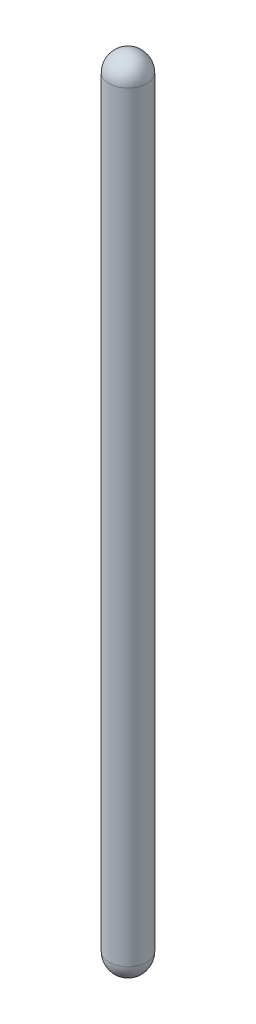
ISO-10303-21;
HEADER;
FILE_DESCRIPTION(('STEP AP214'),'2;1');
FILE_NAME('part.step','',(''),(''),'','','');
FILE_SCHEMA(('AUTOMOTIVE_DESIGN { 1 0 10303 214 1 1 1 1 }'));
ENDSEC;
DATA;
#1=APPLICATION_CONTEXT('core data for automotive mechanical design processes');
#2=APPLICATION_PROTOCOL_DEFINITION('international standard','automotive_design',2000,#1);
#3=PRODUCT_CONTEXT('',#1,'mechanical');
#4=PRODUCT('Part','Part','',(#3));
#5=PRODUCT_RELATED_PRODUCT_CATEGORY('part','',(#4));
#6=PRODUCT_DEFINITION_FORMATION('','',#4);
#7=PRODUCT_DEFINITION_CONTEXT('part definition',#1,'design');
#8=PRODUCT_DEFINITION('design','',#6,#7);
#9=PRODUCT_DEFINITION_SHAPE('','',#8);
#10=(LENGTH_UNIT() NAMED_UNIT(*) SI_UNIT(.MILLI.,.METRE.));
#11=(NAMED_UNIT(*) PLANE_ANGLE_UNIT() SI_UNIT($,.RADIAN.));
#12=(NAMED_UNIT(*) SI_UNIT($,.STERADIAN.) SOLID_ANGLE_UNIT());
#13=UNCERTAINTY_MEASURE_WITH_UNIT(LENGTH_MEASURE(1.E-05),#10,'distance_accuracy_value','');
#14=(GEOMETRIC_REPRESENTATION_CONTEXT(3) GLOBAL_UNCERTAINTY_ASSIGNED_CONTEXT((#13)) GLOBAL_UNIT_ASSIGNED_CONTEXT((#10,
#11,#12)) REPRESENTATION_CONTEXT('',''));
#15=CARTESIAN_POINT('',(0.,0.,0.));
#16=DIRECTION('',(0.,0.,1.));
#17=DIRECTION('',(1.,0.,0.));
#18=AXIS2_PLACEMENT_3D('',#15,#16,#17);
#19=CARTESIAN_POINT('',(0.,200.,0.));
#20=DIRECTION('',(0.,-1.,0.));
#21=DIRECTION('',(0.,0.,-1.));
#22=AXIS2_PLACEMENT_3D('',#19,#20,#21);
#23=CYLINDRICAL_SURFACE('',#22,4.975);
#24=CARTESIAN_POINT('',(0.,200.,0.));
#25=DIRECTION('',(0.,1.,0.));
#26=DIRECTION('',(0.,0.,1.));
#27=AXIS2_PLACEMENT_3D('',#24,#25,#26);
#28=CIRCLE('',#27,4.975);
#29=CARTESIAN_POINT('',(0.,200.,4.975));
#30=VERTEX_POINT('',#29);
#31=EDGE_CURVE('E10',#30,#30,#28,.T.);
#32=ORIENTED_EDGE('',*,*,#31,.F.);
#33=EDGE_LOOP('',(#32));
#34=FACE_BOUND('',#33,.T.);
#35=CARTESIAN_POINT('',(0.,0.,0.));
#36=DIRECTION('',(0.,1.,0.));
#37=DIRECTION('',(0.,0.,1.));
#38=AXIS2_PLACEMENT_3D('',#35,#36,#37);
#39=CIRCLE('',#38,4.975);
#40=CARTESIAN_POINT('',(0.,0.,4.975));
#41=VERTEX_POINT('',#40);
#42=EDGE_CURVE('E37',#41,#41,#39,.T.);
#43=ORIENTED_EDGE('',*,*,#42,.T.);
#44=EDGE_LOOP('',(#43));
#45=FACE_BOUND('',#44,.T.);
#46=ADVANCED_FACE('F33',(#34,#45),#23,.T.);
#47=CARTESIAN_POINT('',(0.,200.,0.));
#48=DIRECTION('',(0.,0.,1.));
#49=DIRECTION('',(1.,0.,0.));
#50=AXIS2_PLACEMENT_3D('',#47,#48,#49);
#51=SPHERICAL_SURFACE('',#50,4.975);
#52=CARTESIAN_POINT('',(0.,200.,0.));
#53=DIRECTION('',(0.,1.,0.));
#54=DIRECTION('',(0.,0.,1.));
#55=AXIS2_PLACEMENT_3D('',#52,#53,#54);
#56=SPHERICAL_SURFACE('',#55,4.975);
#57=ORIENTED_EDGE('',*,*,#31,.T.);
#58=EDGE_LOOP('',(#57));
#59=FACE_BOUND('',#58,.T.);
#60=ADVANCED_FACE('F48',(#59),#56,.T.);
#61=CARTESIAN_POINT('',(0.,0.,0.));
#62=DIRECTION('',(0.,0.,1.));
#63=DIRECTION('',(1.,0.,0.));
#64=AXIS2_PLACEMENT_3D('',#61,#62,#63);
#65=SPHERICAL_SURFACE('',#64,4.975);
#66=CARTESIAN_POINT('',(0.,0.,0.));
#67=DIRECTION('',(0.,1.,0.));
#68=DIRECTION('',(0.,0.,1.));
#69=AXIS2_PLACEMENT_3D('',#66,#67,#68);
#70=SPHERICAL_SURFACE('',#69,4.975);
#71=ORIENTED_EDGE('',*,*,#42,.F.);
#72=EDGE_LOOP('',(#71));
#73=FACE_BOUND('',#72,.T.);
#74=ADVANCED_FACE('F35',(#73),#70,.T.);
#75=CLOSED_SHELL('',(#46,#60,#74));
#76=MANIFOLD_SOLID_BREP('B2',#75);
#77=ADVANCED_BREP_SHAPE_REPRESENTATION('',(#18,#76),#14);
#78=SHAPE_DEFINITION_REPRESENTATION(#9,#77);
ENDSEC;
END-ISO-10303-21;
